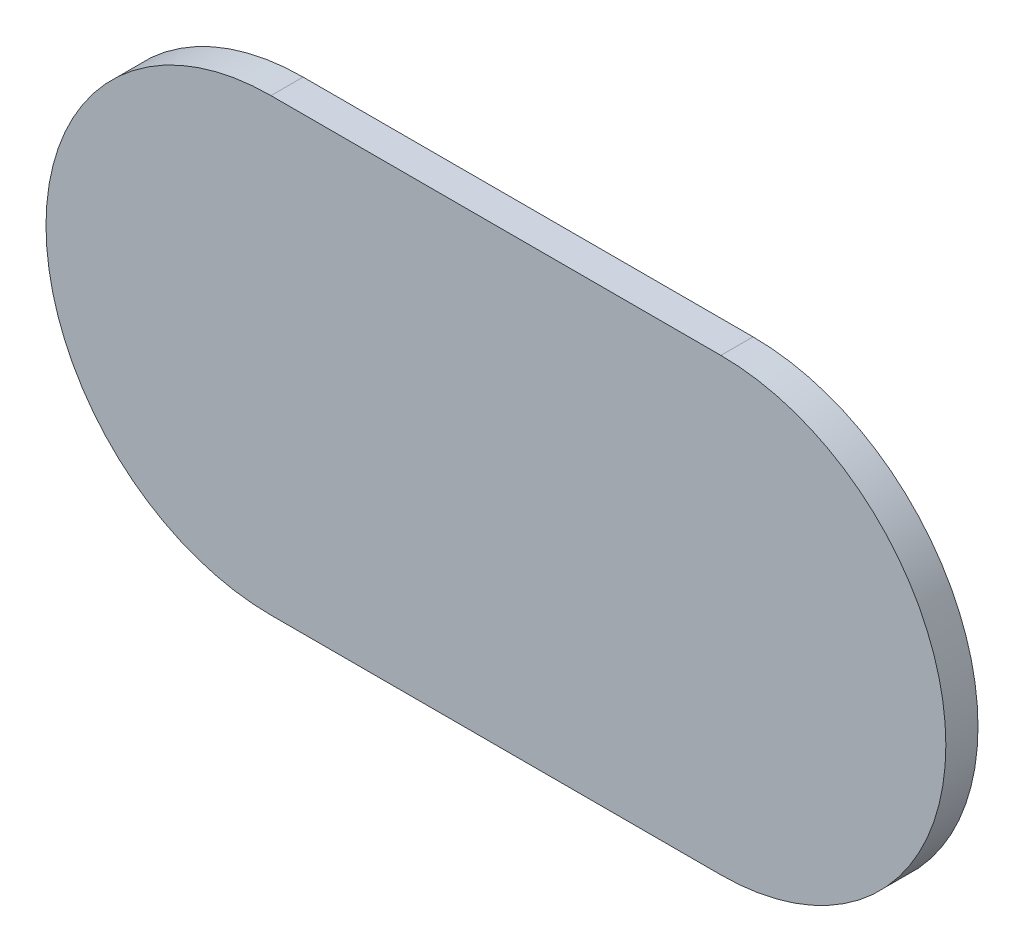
ISO-10303-21;
HEADER;
FILE_DESCRIPTION(('STEP AP214'),'2;1');
FILE_NAME('part.step','',(''),(''),'','','');
FILE_SCHEMA(('AUTOMOTIVE_DESIGN { 1 0 10303 214 1 1 1 1 }'));
ENDSEC;
DATA;
#1=APPLICATION_CONTEXT('core data for automotive mechanical design processes');
#2=APPLICATION_PROTOCOL_DEFINITION('international standard','automotive_design',2000,#1);
#3=PRODUCT_CONTEXT('',#1,'mechanical');
#4=PRODUCT('Part','Part','',(#3));
#5=PRODUCT_RELATED_PRODUCT_CATEGORY('part','',(#4));
#6=PRODUCT_DEFINITION_FORMATION('','',#4);
#7=PRODUCT_DEFINITION_CONTEXT('part definition',#1,'design');
#8=PRODUCT_DEFINITION('design','',#6,#7);
#9=PRODUCT_DEFINITION_SHAPE('','',#8);
#10=(LENGTH_UNIT() NAMED_UNIT(*) SI_UNIT(.MILLI.,.METRE.));
#11=(NAMED_UNIT(*) PLANE_ANGLE_UNIT() SI_UNIT($,.RADIAN.));
#12=(NAMED_UNIT(*) SI_UNIT($,.STERADIAN.) SOLID_ANGLE_UNIT());
#13=UNCERTAINTY_MEASURE_WITH_UNIT(LENGTH_MEASURE(1.E-05),#10,'distance_accuracy_value','');
#14=(GEOMETRIC_REPRESENTATION_CONTEXT(3) GLOBAL_UNCERTAINTY_ASSIGNED_CONTEXT((#13)) GLOBAL_UNIT_ASSIGNED_CONTEXT((#10,
#11,#12)) REPRESENTATION_CONTEXT('',''));
#15=CARTESIAN_POINT('',(0.,0.,0.));
#16=DIRECTION('',(0.,0.,1.));
#17=DIRECTION('',(1.,0.,0.));
#18=AXIS2_PLACEMENT_3D('',#15,#16,#17);
#19=CARTESIAN_POINT('',(0.,0.,0.));
#20=DIRECTION('',(0.,0.,1.));
#21=DIRECTION('',(1.,0.,0.));
#22=AXIS2_PLACEMENT_3D('',#19,#20,#21);
#23=PLANE('',#22);
#24=DIRECTION('',(-1.,0.,0.));
#25=VECTOR('',#24,1.);
#26=CARTESIAN_POINT('',(0.,-7.,0.));
#27=LINE('',#26,#25);
#28=CARTESIAN_POINT('',(0.,-7.,0.));
#29=VERTEX_POINT('',#28);
#30=CARTESIAN_POINT('',(-14.,-6.99999999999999,0.));
#31=VERTEX_POINT('',#30);
#32=EDGE_CURVE('E56',#29,#31,#27,.T.);
#33=ORIENTED_EDGE('',*,*,#32,.T.);
#34=CARTESIAN_POINT('',(-14.,0.,0.));
#35=DIRECTION('',(0.,0.,-1.));
#36=DIRECTION('',(-1.,0.,0.));
#37=AXIS2_PLACEMENT_3D('',#34,#35,#36);
#38=CIRCLE('',#37,7.);
#39=CARTESIAN_POINT('',(-14.,7.00000000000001,0.));
#40=VERTEX_POINT('',#39);
#41=EDGE_CURVE('E81',#40,#31,#38,.F.);
#42=ORIENTED_EDGE('',*,*,#41,.F.);
#43=DIRECTION('',(1.,0.,0.));
#44=VECTOR('',#43,1.);
#45=CARTESIAN_POINT('',(0.,7.,0.));
#46=LINE('',#45,#44);
#47=CARTESIAN_POINT('',(0.,7.,0.));
#48=VERTEX_POINT('',#47);
#49=EDGE_CURVE('E59',#40,#48,#46,.T.);
#50=ORIENTED_EDGE('',*,*,#49,.T.);
#51=CARTESIAN_POINT('',(0.,0.,0.));
#52=DIRECTION('',(0.,0.,-1.));
#53=DIRECTION('',(-1.,0.,0.));
#54=AXIS2_PLACEMENT_3D('',#51,#52,#53);
#55=CIRCLE('',#54,7.);
#56=EDGE_CURVE('E19',#29,#48,#55,.F.);
#57=ORIENTED_EDGE('',*,*,#56,.F.);
#58=EDGE_LOOP('',(#33,#42,#50,#57));
#59=FACE_BOUND('',#58,.T.);
#60=ADVANCED_FACE('F16',(#59),#23,.F.);
#61=CARTESIAN_POINT('',(0.,0.,1.));
#62=DIRECTION('',(0.,0.,-1.));
#63=DIRECTION('',(-1.,0.,0.));
#64=AXIS2_PLACEMENT_3D('',#61,#62,#63);
#65=CYLINDRICAL_SURFACE('',#64,7.);
#66=CARTESIAN_POINT('',(0.,0.,1.));
#67=DIRECTION('',(0.,0.,-1.));
#68=DIRECTION('',(-1.,0.,0.));
#69=AXIS2_PLACEMENT_3D('',#66,#67,#68);
#70=CIRCLE('',#69,7.);
#71=CARTESIAN_POINT('',(0.,-7.,1.));
#72=VERTEX_POINT('',#71);
#73=CARTESIAN_POINT('',(0.,7.,1.));
#74=VERTEX_POINT('',#73);
#75=EDGE_CURVE('E67',#72,#74,#70,.F.);
#76=ORIENTED_EDGE('',*,*,#75,.F.);
#77=DIRECTION('',(0.,0.,1.));
#78=VECTOR('',#77,1.);
#79=CARTESIAN_POINT('',(0.,-7.,1.));
#80=LINE('',#79,#78);
#81=EDGE_CURVE('E64',#72,#29,#80,.F.);
#82=ORIENTED_EDGE('',*,*,#81,.T.);
#83=ORIENTED_EDGE('',*,*,#56,.T.);
#84=DIRECTION('',(0.,0.,1.));
#85=VECTOR('',#84,1.);
#86=CARTESIAN_POINT('',(0.,7.,1.));
#87=LINE('',#86,#85);
#88=EDGE_CURVE('E62',#48,#74,#87,.T.);
#89=ORIENTED_EDGE('',*,*,#88,.T.);
#90=EDGE_LOOP('',(#76,#82,#83,#89));
#91=FACE_BOUND('',#90,.T.);
#92=ADVANCED_FACE('F65',(#91),#65,.T.);
#93=CARTESIAN_POINT('',(0.,7.,1.));
#94=DIRECTION('',(0.,-1.,0.));
#95=DIRECTION('',(1.,0.,0.));
#96=AXIS2_PLACEMENT_3D('',#93,#94,#95);
#97=PLANE('',#96);
#98=DIRECTION('',(0.,0.,-1.));
#99=VECTOR('',#98,1.);
#100=CARTESIAN_POINT('',(-14.,7.00000000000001,1.));
#101=LINE('',#100,#99);
#102=CARTESIAN_POINT('',(-14.,7.,1.));
#103=VERTEX_POINT('',#102);
#104=EDGE_CURVE('E80',#103,#40,#101,.T.);
#105=ORIENTED_EDGE('',*,*,#104,.F.);
#106=DIRECTION('',(1.,0.,0.));
#107=VECTOR('',#106,1.);
#108=CARTESIAN_POINT('',(0.,7.,1.));
#109=LINE('',#108,#107);
#110=EDGE_CURVE('E74',#74,#103,#109,.F.);
#111=ORIENTED_EDGE('',*,*,#110,.F.);
#112=ORIENTED_EDGE('',*,*,#88,.F.);
#113=ORIENTED_EDGE('',*,*,#49,.F.);
#114=EDGE_LOOP('',(#105,#111,#112,#113));
#115=FACE_BOUND('',#114,.T.);
#116=ADVANCED_FACE('F89',(#115),#97,.F.);
#117=CARTESIAN_POINT('',(-14.,0.,1.));
#118=DIRECTION('',(0.,0.,-1.));
#119=DIRECTION('',(-1.,0.,0.));
#120=AXIS2_PLACEMENT_3D('',#117,#118,#119);
#121=CYLINDRICAL_SURFACE('',#120,7.);
#122=ORIENTED_EDGE('',*,*,#41,.T.);
#123=DIRECTION('',(0.,0.,1.));
#124=VECTOR('',#123,1.);
#125=CARTESIAN_POINT('',(-14.,-6.99999999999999,1.));
#126=LINE('',#125,#124);
#127=CARTESIAN_POINT('',(-14.,-6.99999999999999,1.));
#128=VERTEX_POINT('',#127);
#129=EDGE_CURVE('E70',#31,#128,#126,.T.);
#130=ORIENTED_EDGE('',*,*,#129,.T.);
#131=CARTESIAN_POINT('',(-14.,0.,1.));
#132=DIRECTION('',(0.,0.,-1.));
#133=DIRECTION('',(-1.,0.,0.));
#134=AXIS2_PLACEMENT_3D('',#131,#132,#133);
#135=CIRCLE('',#134,7.);
#136=EDGE_CURVE('E25',#103,#128,#135,.F.);
#137=ORIENTED_EDGE('',*,*,#136,.F.);
#138=ORIENTED_EDGE('',*,*,#104,.T.);
#139=EDGE_LOOP('',(#122,#130,#137,#138));
#140=FACE_BOUND('',#139,.T.);
#141=ADVANCED_FACE('F90',(#140),#121,.T.);
#142=CARTESIAN_POINT('',(0.,-7.,1.));
#143=DIRECTION('',(0.,1.,0.));
#144=DIRECTION('',(-1.,0.,0.));
#145=AXIS2_PLACEMENT_3D('',#142,#143,#144);
#146=PLANE('',#145);
#147=ORIENTED_EDGE('',*,*,#81,.F.);
#148=DIRECTION('',(1.,0.,0.));
#149=VECTOR('',#148,1.);
#150=CARTESIAN_POINT('',(0.,-6.99999999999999,1.));
#151=LINE('',#150,#149);
#152=EDGE_CURVE('E10',#128,#72,#151,.T.);
#153=ORIENTED_EDGE('',*,*,#152,.F.);
#154=ORIENTED_EDGE('',*,*,#129,.F.);
#155=ORIENTED_EDGE('',*,*,#32,.F.);
#156=EDGE_LOOP('',(#147,#153,#154,#155));
#157=FACE_BOUND('',#156,.T.);
#158=ADVANCED_FACE('F72',(#157),#146,.F.);
#159=CARTESIAN_POINT('',(0.,0.,1.));
#160=DIRECTION('',(0.,0.,1.));
#161=DIRECTION('',(1.,0.,0.));
#162=AXIS2_PLACEMENT_3D('',#159,#160,#161);
#163=PLANE('',#162);
#164=ORIENTED_EDGE('',*,*,#136,.T.);
#165=ORIENTED_EDGE('',*,*,#152,.T.);
#166=ORIENTED_EDGE('',*,*,#75,.T.);
#167=ORIENTED_EDGE('',*,*,#110,.T.);
#168=EDGE_LOOP('',(#164,#165,#166,#167));
#169=FACE_BOUND('',#168,.T.);
#170=ADVANCED_FACE('F87',(#169),#163,.T.);
#171=CLOSED_SHELL('',(#60,#92,#116,#141,#158,#170));
#172=MANIFOLD_SOLID_BREP('B1',#171);
#173=ADVANCED_BREP_SHAPE_REPRESENTATION('',(#18,#172),#14);
#174=SHAPE_DEFINITION_REPRESENTATION(#9,#173);
ENDSEC;
END-ISO-10303-21;
